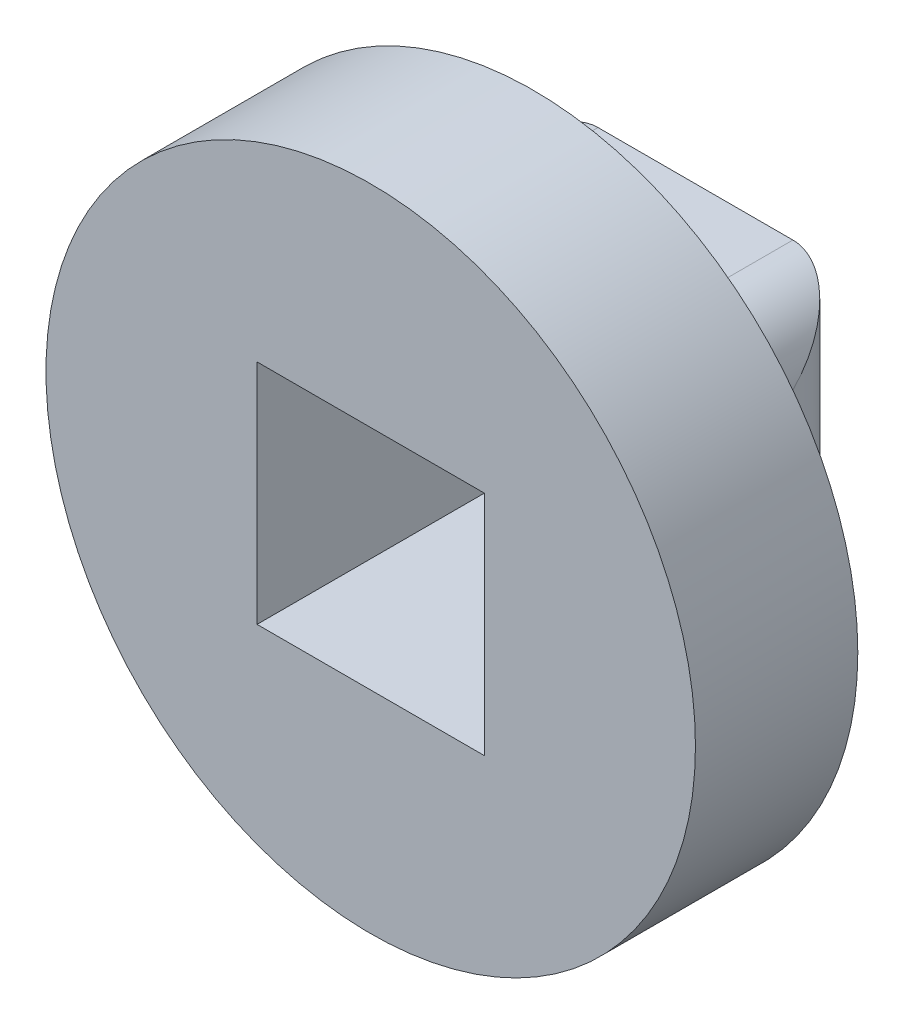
ISO-10303-21;
HEADER;
FILE_DESCRIPTION(('STEP AP214'),'2;1');
FILE_NAME('part.step','',(''),(''),'','','');
FILE_SCHEMA(('AUTOMOTIVE_DESIGN { 1 0 10303 214 1 1 1 1 }'));
ENDSEC;
DATA;
#1=APPLICATION_CONTEXT('core data for automotive mechanical design processes');
#2=APPLICATION_PROTOCOL_DEFINITION('international standard','automotive_design',2000,#1);
#3=PRODUCT_CONTEXT('',#1,'mechanical');
#4=PRODUCT('Part','Part','',(#3));
#5=PRODUCT_RELATED_PRODUCT_CATEGORY('part','',(#4));
#6=PRODUCT_DEFINITION_FORMATION('','',#4);
#7=PRODUCT_DEFINITION_CONTEXT('part definition',#1,'design');
#8=PRODUCT_DEFINITION('design','',#6,#7);
#9=PRODUCT_DEFINITION_SHAPE('','',#8);
#10=(LENGTH_UNIT() NAMED_UNIT(*) SI_UNIT(.MILLI.,.METRE.));
#11=(NAMED_UNIT(*) PLANE_ANGLE_UNIT() SI_UNIT($,.RADIAN.));
#12=(NAMED_UNIT(*) SI_UNIT($,.STERADIAN.) SOLID_ANGLE_UNIT());
#13=UNCERTAINTY_MEASURE_WITH_UNIT(LENGTH_MEASURE(1.E-05),#10,'distance_accuracy_value','');
#14=(GEOMETRIC_REPRESENTATION_CONTEXT(3) GLOBAL_UNCERTAINTY_ASSIGNED_CONTEXT((#13)) GLOBAL_UNIT_ASSIGNED_CONTEXT((#10,
#11,#12)) REPRESENTATION_CONTEXT('',''));
#15=CARTESIAN_POINT('',(0.,0.,0.));
#16=DIRECTION('',(0.,0.,1.));
#17=DIRECTION('',(1.,0.,0.));
#18=AXIS2_PLACEMENT_3D('',#15,#16,#17);
#19=CARTESIAN_POINT('',(0.,0.,-5.));
#20=DIRECTION('',(0.,0.,-1.));
#21=DIRECTION('',(-1.,0.,0.));
#22=AXIS2_PLACEMENT_3D('',#19,#20,#21);
#23=PLANE('',#22);
#24=DIRECTION('',(-1.,0.,0.));
#25=VECTOR('',#24,1.);
#26=CARTESIAN_POINT('',(5.,-5.,-5.));
#27=LINE('',#26,#25);
#28=CARTESIAN_POINT('',(3.,-5.,-5.));
#29=VERTEX_POINT('',#28);
#30=CARTESIAN_POINT('',(-3.,-5.,-5.));
#31=VERTEX_POINT('',#30);
#32=EDGE_CURVE('E192',#29,#31,#27,.T.);
#33=ORIENTED_EDGE('',*,*,#32,.T.);
#34=DIRECTION('',(0.,1.,0.));
#35=VECTOR('',#34,1.);
#36=CARTESIAN_POINT('',(-3.,5.,-5.));
#37=LINE('',#36,#35);
#38=CARTESIAN_POINT('',(-3.,-3.5,-5.));
#39=VERTEX_POINT('',#38);
#40=EDGE_CURVE('E306',#31,#39,#37,.T.);
#41=ORIENTED_EDGE('',*,*,#40,.T.);
#42=DIRECTION('',(-1.,0.,0.));
#43=VECTOR('',#42,1.);
#44=CARTESIAN_POINT('',(3.5,-3.5,-5.));
#45=LINE('',#44,#43);
#46=CARTESIAN_POINT('',(3.,-3.5,-5.));
#47=VERTEX_POINT('',#46);
#48=EDGE_CURVE('E183',#47,#39,#45,.T.);
#49=ORIENTED_EDGE('',*,*,#48,.F.);
#50=DIRECTION('',(0.,-1.,0.));
#51=VECTOR('',#50,1.);
#52=CARTESIAN_POINT('',(3.,-5.,-5.));
#53=LINE('',#52,#51);
#54=EDGE_CURVE('E297',#47,#29,#53,.T.);
#55=ORIENTED_EDGE('',*,*,#54,.T.);
#56=EDGE_LOOP('',(#33,#41,#49,#55));
#57=FACE_BOUND('',#56,.T.);
#58=ADVANCED_FACE('F43',(#57),#23,.T.);
#59=CARTESIAN_POINT('',(0.,0.,0.));
#60=DIRECTION('',(0.,0.,1.));
#61=DIRECTION('',(1.,0.,0.));
#62=AXIS2_PLACEMENT_3D('',#59,#60,#61);
#63=PLANE('',#62);
#64=CARTESIAN_POINT('',(0.,0.,0.));
#65=DIRECTION('',(0.,0.,1.));
#66=DIRECTION('',(1.,0.,0.));
#67=AXIS2_PLACEMENT_3D('',#64,#65,#66);
#68=CIRCLE('',#67,10.);
#69=CARTESIAN_POINT('',(10.,0.,0.));
#70=VERTEX_POINT('',#69);
#71=EDGE_CURVE('E228',#70,#70,#68,.T.);
#72=ORIENTED_EDGE('',*,*,#71,.F.);
#73=EDGE_LOOP('',(#72));
#74=FACE_BOUND('',#73,.T.);
#75=CARTESIAN_POINT('',(-3.,3.,0.));
#76=DIRECTION('',(0.,0.,1.));
#77=DIRECTION('',(1.,0.,0.));
#78=AXIS2_PLACEMENT_3D('',#75,#76,#77);
#79=CIRCLE('',#78,4.);
#80=CARTESIAN_POINT('',(-7.,3.,0.));
#81=VERTEX_POINT('',#80);
#82=CARTESIAN_POINT('',(-3.,7.,0.));
#83=VERTEX_POINT('',#82);
#84=EDGE_CURVE('E271',#81,#83,#79,.F.);
#85=ORIENTED_EDGE('',*,*,#84,.F.);
#86=DIRECTION('',(0.,1.,0.));
#87=VECTOR('',#86,1.);
#88=CARTESIAN_POINT('',(-7.,-5.,0.));
#89=LINE('',#88,#87);
#90=CARTESIAN_POINT('',(-7.,-3.,0.));
#91=VERTEX_POINT('',#90);
#92=EDGE_CURVE('E268',#81,#91,#89,.F.);
#93=ORIENTED_EDGE('',*,*,#92,.T.);
#94=CARTESIAN_POINT('',(-3.,-3.,0.));
#95=DIRECTION('',(0.,0.,1.));
#96=DIRECTION('',(1.,0.,0.));
#97=AXIS2_PLACEMENT_3D('',#94,#95,#96);
#98=CIRCLE('',#97,4.);
#99=CARTESIAN_POINT('',(-3.,-7.,0.));
#100=VERTEX_POINT('',#99);
#101=EDGE_CURVE('E264',#100,#91,#98,.F.);
#102=ORIENTED_EDGE('',*,*,#101,.F.);
#103=DIRECTION('',(-1.,0.,0.));
#104=VECTOR('',#103,1.);
#105=CARTESIAN_POINT('',(5.,-7.,0.));
#106=LINE('',#105,#104);
#107=CARTESIAN_POINT('',(3.,-7.,0.));
#108=VERTEX_POINT('',#107);
#109=EDGE_CURVE('E257',#100,#108,#106,.F.);
#110=ORIENTED_EDGE('',*,*,#109,.T.);
#111=CARTESIAN_POINT('',(3.,-3.,0.));
#112=DIRECTION('',(0.,0.,1.));
#113=DIRECTION('',(1.,0.,0.));
#114=AXIS2_PLACEMENT_3D('',#111,#112,#113);
#115=CIRCLE('',#114,4.);
#116=CARTESIAN_POINT('',(7.,-3.,0.));
#117=VERTEX_POINT('',#116);
#118=EDGE_CURVE('E253',#117,#108,#115,.F.);
#119=ORIENTED_EDGE('',*,*,#118,.F.);
#120=DIRECTION('',(0.,-1.,0.));
#121=VECTOR('',#120,1.);
#122=CARTESIAN_POINT('',(7.,5.,0.));
#123=LINE('',#122,#121);
#124=CARTESIAN_POINT('',(7.,3.,0.));
#125=VERTEX_POINT('',#124);
#126=EDGE_CURVE('E250',#117,#125,#123,.F.);
#127=ORIENTED_EDGE('',*,*,#126,.T.);
#128=CARTESIAN_POINT('',(3.,3.,0.));
#129=DIRECTION('',(0.,0.,1.));
#130=DIRECTION('',(1.,0.,0.));
#131=AXIS2_PLACEMENT_3D('',#128,#129,#130);
#132=CIRCLE('',#131,4.);
#133=CARTESIAN_POINT('',(3.,7.,0.));
#134=VERTEX_POINT('',#133);
#135=EDGE_CURVE('E246',#134,#125,#132,.F.);
#136=ORIENTED_EDGE('',*,*,#135,.F.);
#137=DIRECTION('',(1.,0.,0.));
#138=VECTOR('',#137,1.);
#139=CARTESIAN_POINT('',(-5.,7.,0.));
#140=LINE('',#139,#138);
#141=EDGE_CURVE('E260',#134,#83,#140,.F.);
#142=ORIENTED_EDGE('',*,*,#141,.T.);
#143=EDGE_LOOP('',(#85,#93,#102,#110,#119,#127,#136,#142));
#144=FACE_BOUND('',#143,.T.);
#145=ADVANCED_FACE('F401',(#74,#144),#63,.F.);
#146=CARTESIAN_POINT('',(0.,0.,5.));
#147=DIRECTION('',(0.,0.,1.));
#148=DIRECTION('',(1.,0.,0.));
#149=AXIS2_PLACEMENT_3D('',#146,#147,#148);
#150=PLANE('',#149);
#151=CARTESIAN_POINT('',(0.,0.,5.));
#152=DIRECTION('',(0.,0.,1.));
#153=DIRECTION('',(1.,0.,0.));
#154=AXIS2_PLACEMENT_3D('',#151,#152,#153);
#155=CIRCLE('',#154,10.);
#156=CARTESIAN_POINT('',(10.,0.,5.));
#157=VERTEX_POINT('',#156);
#158=EDGE_CURVE('E229',#157,#157,#155,.T.);
#159=ORIENTED_EDGE('',*,*,#158,.T.);
#160=EDGE_LOOP('',(#159));
#161=FACE_BOUND('',#160,.T.);
#162=DIRECTION('',(0.,-1.,0.));
#163=VECTOR('',#162,1.);
#164=CARTESIAN_POINT('',(-3.5,3.5,5.));
#165=LINE('',#164,#163);
#166=CARTESIAN_POINT('',(-3.5,3.5,5.));
#167=VERTEX_POINT('',#166);
#168=CARTESIAN_POINT('',(-3.5,-3.5,5.));
#169=VERTEX_POINT('',#168);
#170=EDGE_CURVE('E182',#167,#169,#165,.T.);
#171=ORIENTED_EDGE('',*,*,#170,.F.);
#172=DIRECTION('',(-1.,0.,0.));
#173=VECTOR('',#172,1.);
#174=CARTESIAN_POINT('',(3.5,3.5,5.));
#175=LINE('',#174,#173);
#176=CARTESIAN_POINT('',(3.5,3.5,5.));
#177=VERTEX_POINT('',#176);
#178=EDGE_CURVE('E170',#177,#167,#175,.T.);
#179=ORIENTED_EDGE('',*,*,#178,.F.);
#180=DIRECTION('',(0.,-1.,0.));
#181=VECTOR('',#180,1.);
#182=CARTESIAN_POINT('',(3.5,3.5,5.));
#183=LINE('',#182,#181);
#184=CARTESIAN_POINT('',(3.5,-3.5,5.));
#185=VERTEX_POINT('',#184);
#186=EDGE_CURVE('E201',#177,#185,#183,.T.);
#187=ORIENTED_EDGE('',*,*,#186,.T.);
#188=DIRECTION('',(-1.,0.,0.));
#189=VECTOR('',#188,1.);
#190=CARTESIAN_POINT('',(3.5,-3.5,5.));
#191=LINE('',#190,#189);
#192=EDGE_CURVE('E197',#185,#169,#191,.T.);
#193=ORIENTED_EDGE('',*,*,#192,.T.);
#194=EDGE_LOOP('',(#171,#179,#187,#193));
#195=FACE_BOUND('',#194,.T.);
#196=ADVANCED_FACE('F196',(#161,#195),#150,.T.);
#197=DIRECTION('',(-1.,0.,0.));
#198=VECTOR('',#197,1.);
#199=CARTESIAN_POINT('',(3.5,3.5,-5.));
#200=LINE('',#199,#198);
#201=CARTESIAN_POINT('',(3.,3.5,-5.));
#202=VERTEX_POINT('',#201);
#203=CARTESIAN_POINT('',(-3.,3.5,-5.));
#204=VERTEX_POINT('',#203);
#205=EDGE_CURVE('E206',#202,#204,#200,.T.);
#206=ORIENTED_EDGE('',*,*,#205,.T.);
#207=DIRECTION('',(0.,1.,0.));
#208=VECTOR('',#207,1.);
#209=CARTESIAN_POINT('',(-3.,5.,-5.));
#210=LINE('',#209,#208);
#211=CARTESIAN_POINT('',(-3.,5.,-5.));
#212=VERTEX_POINT('',#211);
#213=EDGE_CURVE('E303',#204,#212,#210,.T.);
#214=ORIENTED_EDGE('',*,*,#213,.T.);
#215=DIRECTION('',(1.,0.,0.));
#216=VECTOR('',#215,1.);
#217=CARTESIAN_POINT('',(5.,5.,-5.));
#218=LINE('',#217,#216);
#219=CARTESIAN_POINT('',(3.,5.,-5.));
#220=VERTEX_POINT('',#219);
#221=EDGE_CURVE('E224',#212,#220,#218,.T.);
#222=ORIENTED_EDGE('',*,*,#221,.T.);
#223=DIRECTION('',(0.,-1.,0.));
#224=VECTOR('',#223,1.);
#225=CARTESIAN_POINT('',(3.,-5.,-5.));
#226=LINE('',#225,#224);
#227=EDGE_CURVE('E300',#220,#202,#226,.T.);
#228=ORIENTED_EDGE('',*,*,#227,.T.);
#229=EDGE_LOOP('',(#206,#214,#222,#228));
#230=FACE_BOUND('',#229,.T.);
#231=ADVANCED_FACE('F466',(#230),#23,.T.);
#232=CARTESIAN_POINT('',(0.,0.,5.));
#233=DIRECTION('',(0.,0.,-1.));
#234=DIRECTION('',(-1.,0.,0.));
#235=AXIS2_PLACEMENT_3D('',#232,#233,#234);
#236=CYLINDRICAL_SURFACE('',#235,10.);
#237=ORIENTED_EDGE('',*,*,#158,.F.);
#238=EDGE_LOOP('',(#237));
#239=FACE_BOUND('',#238,.T.);
#240=ORIENTED_EDGE('',*,*,#71,.T.);
#241=EDGE_LOOP('',(#240));
#242=FACE_BOUND('',#241,.T.);
#243=ADVANCED_FACE('F491',(#239,#242),#236,.T.);
#244=CARTESIAN_POINT('',(5.,5.,-5.));
#245=DIRECTION('',(-1.,0.,0.));
#246=DIRECTION('',(0.,0.,1.));
#247=AXIS2_PLACEMENT_3D('',#244,#245,#246);
#248=PLANE('',#247);
#249=DIRECTION('',(0.,-1.,0.));
#250=VECTOR('',#249,1.);
#251=CARTESIAN_POINT('',(5.,5.,-3.));
#252=LINE('',#251,#250);
#253=CARTESIAN_POINT('',(5.,-3.,-3.));
#254=VERTEX_POINT('',#253);
#255=CARTESIAN_POINT('',(5.,3.,-3.));
#256=VERTEX_POINT('',#255);
#257=EDGE_CURVE('E61',#254,#256,#252,.F.);
#258=ORIENTED_EDGE('',*,*,#257,.T.);
#259=DIRECTION('',(0.,0.,1.));
#260=VECTOR('',#259,1.);
#261=CARTESIAN_POINT('',(5.,3.,-5.));
#262=LINE('',#261,#260);
#263=CARTESIAN_POINT('',(5.,3.,-2.));
#264=VERTEX_POINT('',#263);
#265=EDGE_CURVE('E53',#256,#264,#262,.T.);
#266=ORIENTED_EDGE('',*,*,#265,.T.);
#267=DIRECTION('',(0.,-1.,0.));
#268=VECTOR('',#267,1.);
#269=CARTESIAN_POINT('',(5.,-5.,-2.));
#270=LINE('',#269,#268);
#271=CARTESIAN_POINT('',(5.,-3.,-2.));
#272=VERTEX_POINT('',#271);
#273=EDGE_CURVE('E323',#264,#272,#270,.T.);
#274=ORIENTED_EDGE('',*,*,#273,.T.);
#275=DIRECTION('',(0.,0.,1.));
#276=VECTOR('',#275,1.);
#277=CARTESIAN_POINT('',(5.,-3.,-5.));
#278=LINE('',#277,#276);
#279=EDGE_CURVE('E66',#272,#254,#278,.F.);
#280=ORIENTED_EDGE('',*,*,#279,.T.);
#281=EDGE_LOOP('',(#258,#266,#274,#280));
#282=FACE_BOUND('',#281,.T.);
#283=ADVANCED_FACE('F496',(#282),#248,.F.);
#284=CARTESIAN_POINT('',(5.,-5.,-5.));
#285=DIRECTION('',(0.,1.,0.));
#286=DIRECTION('',(0.,0.,1.));
#287=AXIS2_PLACEMENT_3D('',#284,#285,#286);
#288=PLANE('',#287);
#289=DIRECTION('',(-1.,0.,0.));
#290=VECTOR('',#289,1.);
#291=CARTESIAN_POINT('',(-5.,-5.,-2.));
#292=LINE('',#291,#290);
#293=CARTESIAN_POINT('',(3.,-5.,-2.));
#294=VERTEX_POINT('',#293);
#295=CARTESIAN_POINT('',(-3.,-5.,-2.));
#296=VERTEX_POINT('',#295);
#297=EDGE_CURVE('E278',#294,#296,#292,.T.);
#298=ORIENTED_EDGE('',*,*,#297,.T.);
#299=DIRECTION('',(0.,0.,1.));
#300=VECTOR('',#299,1.);
#301=CARTESIAN_POINT('',(-3.,-5.,-5.));
#302=LINE('',#301,#300);
#303=EDGE_CURVE('E281',#296,#31,#302,.F.);
#304=ORIENTED_EDGE('',*,*,#303,.T.);
#305=ORIENTED_EDGE('',*,*,#32,.F.);
#306=DIRECTION('',(0.,0.,1.));
#307=VECTOR('',#306,1.);
#308=CARTESIAN_POINT('',(3.,-5.,-5.));
#309=LINE('',#308,#307);
#310=EDGE_CURVE('E275',#29,#294,#309,.T.);
#311=ORIENTED_EDGE('',*,*,#310,.T.);
#312=EDGE_LOOP('',(#298,#304,#305,#311));
#313=FACE_BOUND('',#312,.T.);
#314=ADVANCED_FACE('F431',(#313),#288,.F.);
#315=CARTESIAN_POINT('',(-5.,5.,-5.));
#316=DIRECTION('',(1.,0.,0.));
#317=DIRECTION('',(0.,1.,0.));
#318=AXIS2_PLACEMENT_3D('',#315,#316,#317);
#319=PLANE('',#318);
#320=DIRECTION('',(0.,1.,0.));
#321=VECTOR('',#320,1.);
#322=CARTESIAN_POINT('',(-5.,-5.,-3.));
#323=LINE('',#322,#321);
#324=CARTESIAN_POINT('',(-5.,3.,-3.));
#325=VERTEX_POINT('',#324);
#326=CARTESIAN_POINT('',(-5.,-3.,-3.));
#327=VERTEX_POINT('',#326);
#328=EDGE_CURVE('E290',#325,#327,#323,.F.);
#329=ORIENTED_EDGE('',*,*,#328,.T.);
#330=DIRECTION('',(0.,0.,1.));
#331=VECTOR('',#330,1.);
#332=CARTESIAN_POINT('',(-5.,-3.,-5.));
#333=LINE('',#332,#331);
#334=CARTESIAN_POINT('',(-5.,-3.,-2.));
#335=VERTEX_POINT('',#334);
#336=EDGE_CURVE('E293',#327,#335,#333,.T.);
#337=ORIENTED_EDGE('',*,*,#336,.T.);
#338=DIRECTION('',(0.,1.,0.));
#339=VECTOR('',#338,1.);
#340=CARTESIAN_POINT('',(-5.,5.,-2.));
#341=LINE('',#340,#339);
#342=CARTESIAN_POINT('',(-5.,3.,-2.));
#343=VERTEX_POINT('',#342);
#344=EDGE_CURVE('E284',#335,#343,#341,.T.);
#345=ORIENTED_EDGE('',*,*,#344,.T.);
#346=DIRECTION('',(0.,0.,1.));
#347=VECTOR('',#346,1.);
#348=CARTESIAN_POINT('',(-5.,3.,-5.));
#349=LINE('',#348,#347);
#350=EDGE_CURVE('E287',#343,#325,#349,.F.);
#351=ORIENTED_EDGE('',*,*,#350,.T.);
#352=EDGE_LOOP('',(#329,#337,#345,#351));
#353=FACE_BOUND('',#352,.T.);
#354=ADVANCED_FACE('F419',(#353),#319,.F.);
#355=CARTESIAN_POINT('',(5.,5.,-5.));
#356=DIRECTION('',(0.,-1.,0.));
#357=DIRECTION('',(1.,0.,0.));
#358=AXIS2_PLACEMENT_3D('',#355,#356,#357);
#359=PLANE('',#358);
#360=ORIENTED_EDGE('',*,*,#221,.F.);
#361=DIRECTION('',(0.,0.,1.));
#362=VECTOR('',#361,1.);
#363=CARTESIAN_POINT('',(-3.,5.,-5.));
#364=LINE('',#363,#362);
#365=CARTESIAN_POINT('',(-3.,5.,-2.));
#366=VERTEX_POINT('',#365);
#367=EDGE_CURVE('E243',#212,#366,#364,.T.);
#368=ORIENTED_EDGE('',*,*,#367,.T.);
#369=DIRECTION('',(1.,0.,0.));
#370=VECTOR('',#369,1.);
#371=CARTESIAN_POINT('',(5.,5.,-2.));
#372=LINE('',#371,#370);
#373=CARTESIAN_POINT('',(3.,5.,-2.));
#374=VERTEX_POINT('',#373);
#375=EDGE_CURVE('E239',#366,#374,#372,.T.);
#376=ORIENTED_EDGE('',*,*,#375,.T.);
#377=DIRECTION('',(0.,0.,1.));
#378=VECTOR('',#377,1.);
#379=CARTESIAN_POINT('',(3.,5.,-5.));
#380=LINE('',#379,#378);
#381=EDGE_CURVE('E233',#374,#220,#380,.F.);
#382=ORIENTED_EDGE('',*,*,#381,.T.);
#383=EDGE_LOOP('',(#360,#368,#376,#382));
#384=FACE_BOUND('',#383,.T.);
#385=ADVANCED_FACE('F463',(#384),#359,.F.);
#386=CARTESIAN_POINT('',(3.5,3.5,5.));
#387=DIRECTION('',(0.,-1.,0.));
#388=DIRECTION('',(1.,0.,0.));
#389=AXIS2_PLACEMENT_3D('',#386,#387,#388);
#390=PLANE('',#389);
#391=DIRECTION('',(0.,0.,-1.));
#392=VECTOR('',#391,1.);
#393=CARTESIAN_POINT('',(-3.5,3.5,5.));
#394=LINE('',#393,#392);
#395=CARTESIAN_POINT('',(-3.5,3.5,-4.93649167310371));
#396=VERTEX_POINT('',#395);
#397=EDGE_CURVE('E173',#167,#396,#394,.T.);
#398=ORIENTED_EDGE('',*,*,#397,.T.);
#399=CARTESIAN_POINT('',(-3.,3.5,-3.));
#400=DIRECTION('',(0.,-1.,0.));
#401=DIRECTION('',(1.,0.,0.));
#402=AXIS2_PLACEMENT_3D('',#399,#400,#401);
#403=CIRCLE('',#402,2.);
#404=EDGE_CURVE('E320',#396,#204,#403,.T.);
#405=ORIENTED_EDGE('',*,*,#404,.T.);
#406=ORIENTED_EDGE('',*,*,#205,.F.);
#407=CARTESIAN_POINT('',(3.,3.5,-3.));
#408=DIRECTION('',(0.,-1.,0.));
#409=DIRECTION('',(1.,0.,0.));
#410=AXIS2_PLACEMENT_3D('',#407,#408,#409);
#411=CIRCLE('',#410,2.);
#412=CARTESIAN_POINT('',(3.5,3.5,-4.93649167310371));
#413=VERTEX_POINT('',#412);
#414=EDGE_CURVE('E317',#202,#413,#411,.T.);
#415=ORIENTED_EDGE('',*,*,#414,.T.);
#416=DIRECTION('',(0.,0.,-1.));
#417=VECTOR('',#416,1.);
#418=CARTESIAN_POINT('',(3.5,3.5,5.));
#419=LINE('',#418,#417);
#420=EDGE_CURVE('E176',#177,#413,#419,.T.);
#421=ORIENTED_EDGE('',*,*,#420,.F.);
#422=ORIENTED_EDGE('',*,*,#178,.T.);
#423=EDGE_LOOP('',(#398,#405,#406,#415,#421,#422));
#424=FACE_BOUND('',#423,.T.);
#425=ADVANCED_FACE('F172',(#424),#390,.T.);
#426=CARTESIAN_POINT('',(-3.5,3.5,5.));
#427=DIRECTION('',(1.,0.,0.));
#428=DIRECTION('',(0.,1.,0.));
#429=AXIS2_PLACEMENT_3D('',#426,#427,#428);
#430=PLANE('',#429);
#431=DIRECTION('',(0.,0.,-1.));
#432=VECTOR('',#431,1.);
#433=CARTESIAN_POINT('',(-3.5,-3.5,5.));
#434=LINE('',#433,#432);
#435=CARTESIAN_POINT('',(-3.5,-3.5,-4.93649167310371));
#436=VERTEX_POINT('',#435);
#437=EDGE_CURVE('E193',#169,#436,#434,.T.);
#438=ORIENTED_EDGE('',*,*,#437,.T.);
#439=DIRECTION('',(0.,-1.,0.));
#440=VECTOR('',#439,1.);
#441=CARTESIAN_POINT('',(-3.5,-3.5,-4.93649167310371));
#442=LINE('',#441,#440);
#443=EDGE_CURVE('E190',#436,#396,#442,.F.);
#444=ORIENTED_EDGE('',*,*,#443,.T.);
#445=ORIENTED_EDGE('',*,*,#397,.F.);
#446=ORIENTED_EDGE('',*,*,#170,.T.);
#447=EDGE_LOOP('',(#438,#444,#445,#446));
#448=FACE_BOUND('',#447,.T.);
#449=ADVANCED_FACE('F187',(#448),#430,.T.);
#450=CARTESIAN_POINT('',(3.5,-3.5,5.));
#451=DIRECTION('',(0.,-1.,0.));
#452=DIRECTION('',(0.,0.,-1.));
#453=AXIS2_PLACEMENT_3D('',#450,#451,#452);
#454=PLANE('',#453);
#455=ORIENTED_EDGE('',*,*,#48,.T.);
#456=CARTESIAN_POINT('',(-3.,-3.5,-3.));
#457=DIRECTION('',(0.,-1.,0.));
#458=DIRECTION('',(0.,0.,-1.));
#459=AXIS2_PLACEMENT_3D('',#456,#457,#458);
#460=CIRCLE('',#459,2.);
#461=EDGE_CURVE('E312',#39,#436,#460,.F.);
#462=ORIENTED_EDGE('',*,*,#461,.T.);
#463=ORIENTED_EDGE('',*,*,#437,.F.);
#464=ORIENTED_EDGE('',*,*,#192,.F.);
#465=DIRECTION('',(0.,0.,-1.));
#466=VECTOR('',#465,1.);
#467=CARTESIAN_POINT('',(3.5,-3.5,5.));
#468=LINE('',#467,#466);
#469=CARTESIAN_POINT('',(3.5,-3.5,-4.93649167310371));
#470=VERTEX_POINT('',#469);
#471=EDGE_CURVE('E215',#185,#470,#468,.T.);
#472=ORIENTED_EDGE('',*,*,#471,.T.);
#473=CARTESIAN_POINT('',(3.,-3.5,-3.));
#474=DIRECTION('',(0.,-1.,0.));
#475=DIRECTION('',(0.,0.,-1.));
#476=AXIS2_PLACEMENT_3D('',#473,#474,#475);
#477=CIRCLE('',#476,2.);
#478=EDGE_CURVE('E309',#470,#47,#477,.F.);
#479=ORIENTED_EDGE('',*,*,#478,.T.);
#480=EDGE_LOOP('',(#455,#462,#463,#464,#472,#479));
#481=FACE_BOUND('',#480,.T.);
#482=ADVANCED_FACE('F472',(#481),#454,.F.);
#483=CARTESIAN_POINT('',(3.5,3.5,5.));
#484=DIRECTION('',(1.,0.,0.));
#485=DIRECTION('',(0.,1.,0.));
#486=AXIS2_PLACEMENT_3D('',#483,#484,#485);
#487=PLANE('',#486);
#488=ORIENTED_EDGE('',*,*,#420,.T.);
#489=DIRECTION('',(0.,1.,0.));
#490=VECTOR('',#489,1.);
#491=CARTESIAN_POINT('',(3.5,3.5,-4.93649167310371));
#492=LINE('',#491,#490);
#493=EDGE_CURVE('E11',#413,#470,#492,.F.);
#494=ORIENTED_EDGE('',*,*,#493,.T.);
#495=ORIENTED_EDGE('',*,*,#471,.F.);
#496=ORIENTED_EDGE('',*,*,#186,.F.);
#497=EDGE_LOOP('',(#488,#494,#495,#496));
#498=FACE_BOUND('',#497,.T.);
#499=ADVANCED_FACE('F469',(#498),#487,.F.);
#500=CARTESIAN_POINT('',(-3.,-3.,-5.));
#501=DIRECTION('',(0.,0.,1.));
#502=DIRECTION('',(1.,0.,0.));
#503=AXIS2_PLACEMENT_3D('',#500,#501,#502);
#504=CYLINDRICAL_SURFACE('',#503,2.);
#505=CARTESIAN_POINT('',(-3.,-3.,-3.));
#506=DIRECTION('',(0.,-0.707106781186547,0.707106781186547));
#507=DIRECTION('',(0.,-0.707106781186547,-0.707106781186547));
#508=AXIS2_PLACEMENT_3D('',#505,#506,#507);
#509=ELLIPSE('',#508,2.82842712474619,2.);
#510=EDGE_CURVE('E381',#31,#327,#509,.F.);
#511=ORIENTED_EDGE('',*,*,#510,.F.);
#512=ORIENTED_EDGE('',*,*,#303,.F.);
#513=CARTESIAN_POINT('',(-3.,-3.,-2.));
#514=DIRECTION('',(0.,0.,1.));
#515=DIRECTION('',(1.,0.,0.));
#516=AXIS2_PLACEMENT_3D('',#513,#514,#515);
#517=CIRCLE('',#516,2.);
#518=EDGE_CURVE('E384',#335,#296,#517,.T.);
#519=ORIENTED_EDGE('',*,*,#518,.F.);
#520=ORIENTED_EDGE('',*,*,#336,.F.);
#521=EDGE_LOOP('',(#511,#512,#519,#520));
#522=FACE_BOUND('',#521,.T.);
#523=ADVANCED_FACE('F45',(#522),#504,.T.);
#524=CARTESIAN_POINT('',(3.,-3.,-5.));
#525=DIRECTION('',(0.,0.,1.));
#526=DIRECTION('',(1.,0.,0.));
#527=AXIS2_PLACEMENT_3D('',#524,#525,#526);
#528=CYLINDRICAL_SURFACE('',#527,2.);
#529=CARTESIAN_POINT('',(3.,-3.,-2.));
#530=DIRECTION('',(0.,0.,1.));
#531=DIRECTION('',(1.,0.,0.));
#532=AXIS2_PLACEMENT_3D('',#529,#530,#531);
#533=CIRCLE('',#532,2.);
#534=EDGE_CURVE('E373',#294,#272,#533,.T.);
#535=ORIENTED_EDGE('',*,*,#534,.F.);
#536=ORIENTED_EDGE('',*,*,#310,.F.);
#537=CARTESIAN_POINT('',(3.,-3.,-3.));
#538=DIRECTION('',(0.,-0.707106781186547,0.707106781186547));
#539=DIRECTION('',(0.,0.707106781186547,0.707106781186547));
#540=AXIS2_PLACEMENT_3D('',#537,#538,#539);
#541=ELLIPSE('',#540,2.82842712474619,2.);
#542=EDGE_CURVE('E377',#254,#29,#541,.F.);
#543=ORIENTED_EDGE('',*,*,#542,.F.);
#544=ORIENTED_EDGE('',*,*,#279,.F.);
#545=EDGE_LOOP('',(#535,#536,#543,#544));
#546=FACE_BOUND('',#545,.T.);
#547=ADVANCED_FACE('F442',(#546),#528,.T.);
#548=CARTESIAN_POINT('',(5.,-7.,-2.));
#549=DIRECTION('',(1.,0.,0.));
#550=DIRECTION('',(0.,0.,-1.));
#551=AXIS2_PLACEMENT_3D('',#548,#549,#550);
#552=CYLINDRICAL_SURFACE('',#551,2.);
#553=CARTESIAN_POINT('',(3.,-7.,-2.));
#554=DIRECTION('',(-1.,0.,0.));
#555=DIRECTION('',(0.,0.,1.));
#556=AXIS2_PLACEMENT_3D('',#553,#554,#555);
#557=CIRCLE('',#556,2.);
#558=EDGE_CURVE('E369',#108,#294,#557,.T.);
#559=ORIENTED_EDGE('',*,*,#558,.F.);
#560=ORIENTED_EDGE('',*,*,#109,.F.);
#561=CARTESIAN_POINT('',(-3.,-7.,-2.));
#562=DIRECTION('',(1.,0.,0.));
#563=DIRECTION('',(0.,0.,-1.));
#564=AXIS2_PLACEMENT_3D('',#561,#562,#563);
#565=CIRCLE('',#564,2.);
#566=EDGE_CURVE('E47',#296,#100,#565,.T.);
#567=ORIENTED_EDGE('',*,*,#566,.F.);
#568=ORIENTED_EDGE('',*,*,#297,.F.);
#569=EDGE_LOOP('',(#559,#560,#567,#568));
#570=FACE_BOUND('',#569,.T.);
#571=ADVANCED_FACE('F398',(#570),#552,.F.);
#572=CARTESIAN_POINT('',(-3.,-3.,-2.));
#573=DIRECTION('',(0.,0.,1.));
#574=DIRECTION('',(1.,0.,0.));
#575=AXIS2_PLACEMENT_3D('',#572,#573,#574);
#576=TOROIDAL_SURFACE('',#575,4.,2.);
#577=ORIENTED_EDGE('',*,*,#566,.T.);
#578=ORIENTED_EDGE('',*,*,#101,.T.);
#579=CARTESIAN_POINT('',(-7.,-3.,-2.));
#580=DIRECTION('',(0.,1.,0.));
#581=DIRECTION('',(-1.,0.,0.));
#582=AXIS2_PLACEMENT_3D('',#579,#580,#581);
#583=CIRCLE('',#582,2.);
#584=EDGE_CURVE('E365',#335,#91,#583,.F.);
#585=ORIENTED_EDGE('',*,*,#584,.F.);
#586=ORIENTED_EDGE('',*,*,#518,.T.);
#587=EDGE_LOOP('',(#577,#578,#585,#586));
#588=FACE_BOUND('',#587,.T.);
#589=ADVANCED_FACE('F393',(#588),#576,.F.);
#590=CARTESIAN_POINT('',(-3.,0.,-3.));
#591=DIRECTION('',(0.,-1.,0.));
#592=DIRECTION('',(1.,0.,0.));
#593=AXIS2_PLACEMENT_3D('',#590,#591,#592);
#594=CYLINDRICAL_SURFACE('',#593,2.);
#595=ORIENTED_EDGE('',*,*,#510,.T.);
#596=ORIENTED_EDGE('',*,*,#328,.F.);
#597=CARTESIAN_POINT('',(-3.,3.,-3.));
#598=DIRECTION('',(0.,0.707106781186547,0.707106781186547));
#599=DIRECTION('',(0.,-0.707106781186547,0.707106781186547));
#600=AXIS2_PLACEMENT_3D('',#597,#598,#599);
#601=ELLIPSE('',#600,2.82842712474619,2.);
#602=EDGE_CURVE('E361',#212,#325,#601,.T.);
#603=ORIENTED_EDGE('',*,*,#602,.F.);
#604=ORIENTED_EDGE('',*,*,#213,.F.);
#605=ORIENTED_EDGE('',*,*,#404,.F.);
#606=ORIENTED_EDGE('',*,*,#443,.F.);
#607=ORIENTED_EDGE('',*,*,#461,.F.);
#608=ORIENTED_EDGE('',*,*,#40,.F.);
#609=EDGE_LOOP('',(#595,#596,#603,#604,#605,#606,#607,#608));
#610=FACE_BOUND('',#609,.T.);
#611=ADVANCED_FACE('F422',(#610),#594,.T.);
#612=CARTESIAN_POINT('',(3.,0.,-3.));
#613=DIRECTION('',(0.,1.,0.));
#614=DIRECTION('',(0.,0.,1.));
#615=AXIS2_PLACEMENT_3D('',#612,#613,#614);
#616=CYLINDRICAL_SURFACE('',#615,2.);
#617=ORIENTED_EDGE('',*,*,#414,.F.);
#618=ORIENTED_EDGE('',*,*,#227,.F.);
#619=CARTESIAN_POINT('',(3.,3.,-3.));
#620=DIRECTION('',(0.,0.707106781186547,0.707106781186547));
#621=DIRECTION('',(0.,0.707106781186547,-0.707106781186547));
#622=AXIS2_PLACEMENT_3D('',#619,#620,#621);
#623=ELLIPSE('',#622,2.82842712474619,2.);
#624=EDGE_CURVE('E357',#256,#220,#623,.T.);
#625=ORIENTED_EDGE('',*,*,#624,.F.);
#626=ORIENTED_EDGE('',*,*,#257,.F.);
#627=ORIENTED_EDGE('',*,*,#542,.T.);
#628=ORIENTED_EDGE('',*,*,#54,.F.);
#629=ORIENTED_EDGE('',*,*,#478,.F.);
#630=ORIENTED_EDGE('',*,*,#493,.F.);
#631=EDGE_LOOP('',(#617,#618,#625,#626,#627,#628,#629,#630));
#632=FACE_BOUND('',#631,.T.);
#633=ADVANCED_FACE('F439',(#632),#616,.T.);
#634=CARTESIAN_POINT('',(3.,-3.,-2.));
#635=DIRECTION('',(0.,0.,1.));
#636=DIRECTION('',(1.,0.,0.));
#637=AXIS2_PLACEMENT_3D('',#634,#635,#636);
#638=TOROIDAL_SURFACE('',#637,4.,2.);
#639=ORIENTED_EDGE('',*,*,#558,.T.);
#640=ORIENTED_EDGE('',*,*,#534,.T.);
#641=CARTESIAN_POINT('',(7.,-3.,-2.));
#642=DIRECTION('',(0.,1.,0.));
#643=DIRECTION('',(0.,0.,1.));
#644=AXIS2_PLACEMENT_3D('',#641,#642,#643);
#645=CIRCLE('',#644,2.);
#646=EDGE_CURVE('E353',#117,#272,#645,.F.);
#647=ORIENTED_EDGE('',*,*,#646,.F.);
#648=ORIENTED_EDGE('',*,*,#118,.T.);
#649=EDGE_LOOP('',(#639,#640,#647,#648));
#650=FACE_BOUND('',#649,.T.);
#651=ADVANCED_FACE('F444',(#650),#638,.F.);
#652=CARTESIAN_POINT('',(-7.,5.,-2.));
#653=DIRECTION('',(0.,-1.,0.));
#654=DIRECTION('',(1.,0.,0.));
#655=AXIS2_PLACEMENT_3D('',#652,#653,#654);
#656=CYLINDRICAL_SURFACE('',#655,2.);
#657=ORIENTED_EDGE('',*,*,#584,.T.);
#658=ORIENTED_EDGE('',*,*,#92,.F.);
#659=CARTESIAN_POINT('',(-7.,3.,-2.));
#660=DIRECTION('',(0.,-1.,0.));
#661=DIRECTION('',(1.,0.,0.));
#662=AXIS2_PLACEMENT_3D('',#659,#660,#661);
#663=CIRCLE('',#662,2.);
#664=EDGE_CURVE('E349',#343,#81,#663,.T.);
#665=ORIENTED_EDGE('',*,*,#664,.F.);
#666=ORIENTED_EDGE('',*,*,#344,.F.);
#667=EDGE_LOOP('',(#657,#658,#665,#666));
#668=FACE_BOUND('',#667,.T.);
#669=ADVANCED_FACE('F406',(#668),#656,.F.);
#670=CARTESIAN_POINT('',(-3.,3.,-5.));
#671=DIRECTION('',(0.,0.,1.));
#672=DIRECTION('',(1.,0.,0.));
#673=AXIS2_PLACEMENT_3D('',#670,#671,#672);
#674=CYLINDRICAL_SURFACE('',#673,2.);
#675=ORIENTED_EDGE('',*,*,#602,.T.);
#676=ORIENTED_EDGE('',*,*,#350,.F.);
#677=CARTESIAN_POINT('',(-3.,3.,-2.));
#678=DIRECTION('',(0.,0.,1.));
#679=DIRECTION('',(1.,0.,0.));
#680=AXIS2_PLACEMENT_3D('',#677,#678,#679);
#681=CIRCLE('',#680,2.);
#682=EDGE_CURVE('E345',#366,#343,#681,.T.);
#683=ORIENTED_EDGE('',*,*,#682,.F.);
#684=ORIENTED_EDGE('',*,*,#367,.F.);
#685=EDGE_LOOP('',(#675,#676,#683,#684));
#686=FACE_BOUND('',#685,.T.);
#687=ADVANCED_FACE('F415',(#686),#674,.T.);
#688=CARTESIAN_POINT('',(3.,3.,-5.));
#689=DIRECTION('',(0.,0.,1.));
#690=DIRECTION('',(1.,0.,0.));
#691=AXIS2_PLACEMENT_3D('',#688,#689,#690);
#692=CYLINDRICAL_SURFACE('',#691,2.);
#693=ORIENTED_EDGE('',*,*,#624,.T.);
#694=ORIENTED_EDGE('',*,*,#381,.F.);
#695=CARTESIAN_POINT('',(3.,3.,-2.));
#696=DIRECTION('',(0.,0.,1.));
#697=DIRECTION('',(1.,0.,0.));
#698=AXIS2_PLACEMENT_3D('',#695,#696,#697);
#699=CIRCLE('',#698,2.);
#700=EDGE_CURVE('E341',#264,#374,#699,.T.);
#701=ORIENTED_EDGE('',*,*,#700,.F.);
#702=ORIENTED_EDGE('',*,*,#265,.F.);
#703=EDGE_LOOP('',(#693,#694,#701,#702));
#704=FACE_BOUND('',#703,.T.);
#705=ADVANCED_FACE('F460',(#704),#692,.T.);
#706=CARTESIAN_POINT('',(7.,5.,-2.));
#707=DIRECTION('',(0.,1.,0.));
#708=DIRECTION('',(0.,0.,1.));
#709=AXIS2_PLACEMENT_3D('',#706,#707,#708);
#710=CYLINDRICAL_SURFACE('',#709,2.);
#711=ORIENTED_EDGE('',*,*,#646,.T.);
#712=ORIENTED_EDGE('',*,*,#273,.F.);
#713=CARTESIAN_POINT('',(7.,3.,-2.));
#714=DIRECTION('',(0.,-1.,0.));
#715=DIRECTION('',(0.,0.,-1.));
#716=AXIS2_PLACEMENT_3D('',#713,#714,#715);
#717=CIRCLE('',#716,2.);
#718=EDGE_CURVE('E338',#125,#264,#717,.T.);
#719=ORIENTED_EDGE('',*,*,#718,.F.);
#720=ORIENTED_EDGE('',*,*,#126,.F.);
#721=EDGE_LOOP('',(#711,#712,#719,#720));
#722=FACE_BOUND('',#721,.T.);
#723=ADVANCED_FACE('F449',(#722),#710,.F.);
#724=CARTESIAN_POINT('',(-3.,3.,-2.));
#725=DIRECTION('',(0.,0.,1.));
#726=DIRECTION('',(1.,0.,0.));
#727=AXIS2_PLACEMENT_3D('',#724,#725,#726);
#728=TOROIDAL_SURFACE('',#727,4.,2.);
#729=ORIENTED_EDGE('',*,*,#664,.T.);
#730=ORIENTED_EDGE('',*,*,#84,.T.);
#731=CARTESIAN_POINT('',(-3.,7.,-2.));
#732=DIRECTION('',(1.,0.,0.));
#733=DIRECTION('',(0.,0.,-1.));
#734=AXIS2_PLACEMENT_3D('',#731,#732,#733);
#735=CIRCLE('',#734,2.);
#736=EDGE_CURVE('E335',#366,#83,#735,.F.);
#737=ORIENTED_EDGE('',*,*,#736,.F.);
#738=ORIENTED_EDGE('',*,*,#682,.T.);
#739=EDGE_LOOP('',(#729,#730,#737,#738));
#740=FACE_BOUND('',#739,.T.);
#741=ADVANCED_FACE('F408',(#740),#728,.F.);
#742=CARTESIAN_POINT('',(3.,3.,-2.));
#743=DIRECTION('',(0.,0.,1.));
#744=DIRECTION('',(1.,0.,0.));
#745=AXIS2_PLACEMENT_3D('',#742,#743,#744);
#746=TOROIDAL_SURFACE('',#745,4.,2.);
#747=ORIENTED_EDGE('',*,*,#718,.T.);
#748=ORIENTED_EDGE('',*,*,#700,.T.);
#749=CARTESIAN_POINT('',(3.,7.,-2.));
#750=DIRECTION('',(-1.,0.,0.));
#751=DIRECTION('',(0.,0.,1.));
#752=AXIS2_PLACEMENT_3D('',#749,#750,#751);
#753=CIRCLE('',#752,2.);
#754=EDGE_CURVE('E332',#134,#374,#753,.F.);
#755=ORIENTED_EDGE('',*,*,#754,.F.);
#756=ORIENTED_EDGE('',*,*,#135,.T.);
#757=EDGE_LOOP('',(#747,#748,#755,#756));
#758=FACE_BOUND('',#757,.T.);
#759=ADVANCED_FACE('F455',(#758),#746,.F.);
#760=CARTESIAN_POINT('',(5.,7.,-2.));
#761=DIRECTION('',(-1.,0.,0.));
#762=DIRECTION('',(0.,-1.,0.));
#763=AXIS2_PLACEMENT_3D('',#760,#761,#762);
#764=CYLINDRICAL_SURFACE('',#763,2.);
#765=ORIENTED_EDGE('',*,*,#736,.T.);
#766=ORIENTED_EDGE('',*,*,#141,.F.);
#767=ORIENTED_EDGE('',*,*,#754,.T.);
#768=ORIENTED_EDGE('',*,*,#375,.F.);
#769=EDGE_LOOP('',(#765,#766,#767,#768));
#770=FACE_BOUND('',#769,.T.);
#771=ADVANCED_FACE('F454',(#770),#764,.F.);
#772=CLOSED_SHELL('',(#58,#145,#196,#231,#243,#283,#314,#354,#385,#425,#449,#482,#499,#523,#547,
#571,#589,#611,#633,#651,#669,#687,#705,#723,#741,#759,#771));
#773=MANIFOLD_SOLID_BREP('B2',#772);
#774=ADVANCED_BREP_SHAPE_REPRESENTATION('',(#18,#773),#14);
#775=SHAPE_DEFINITION_REPRESENTATION(#9,#774);
ENDSEC;
END-ISO-10303-21;
